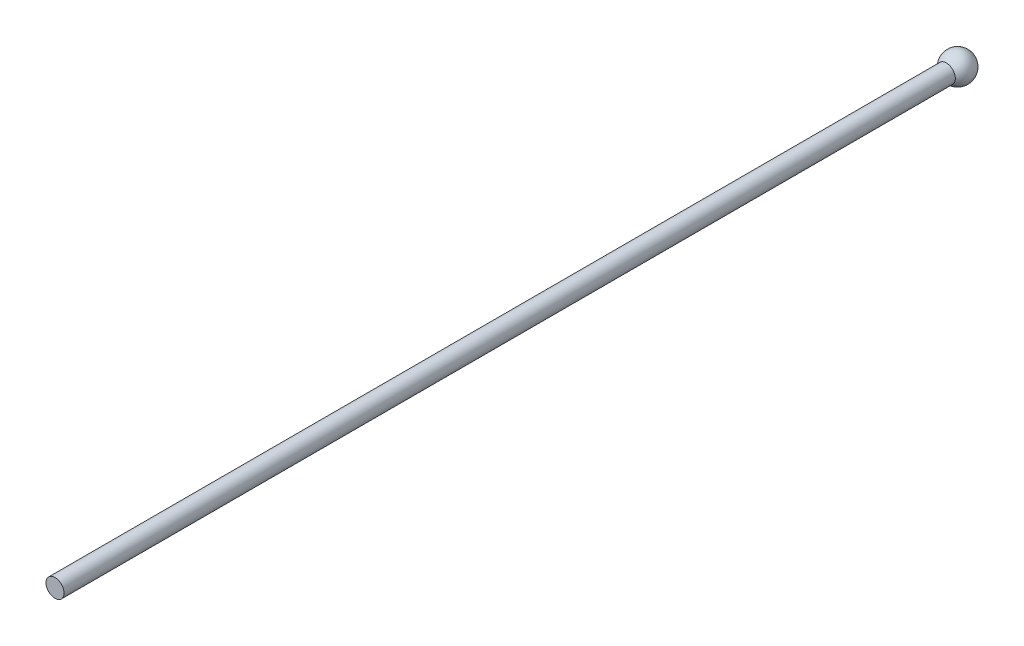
from build123d import *

# Parameters (mm, degrees)
ESQUISSE1_R      = 2.5
EXTRUSION1_DEPTH = 250


with BuildPart() as part:
    # Esquisse1 → Extrusion1 (new body)
    with BuildSketch(Plane.XY):
        Circle(ESQUISSE1_R)
    extrude(amount=EXTRUSION1_DEPTH)

    # Esquisse2 → R_volution5 (revolve)
    with BuildSketch(Plane(origin=(0, 0, 0), x_dir=(1, 0, 0), z_dir=(0, 1, 0))):
        with BuildLine():
            Line((0, 4), (0, -4))
            ThreePointArc((0, -4), (4, 0), (0, 4))
        make_face()
    revolve(axis=Axis((0, 0, -15.640818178), (0, 0, 1)))


solid = part.part
